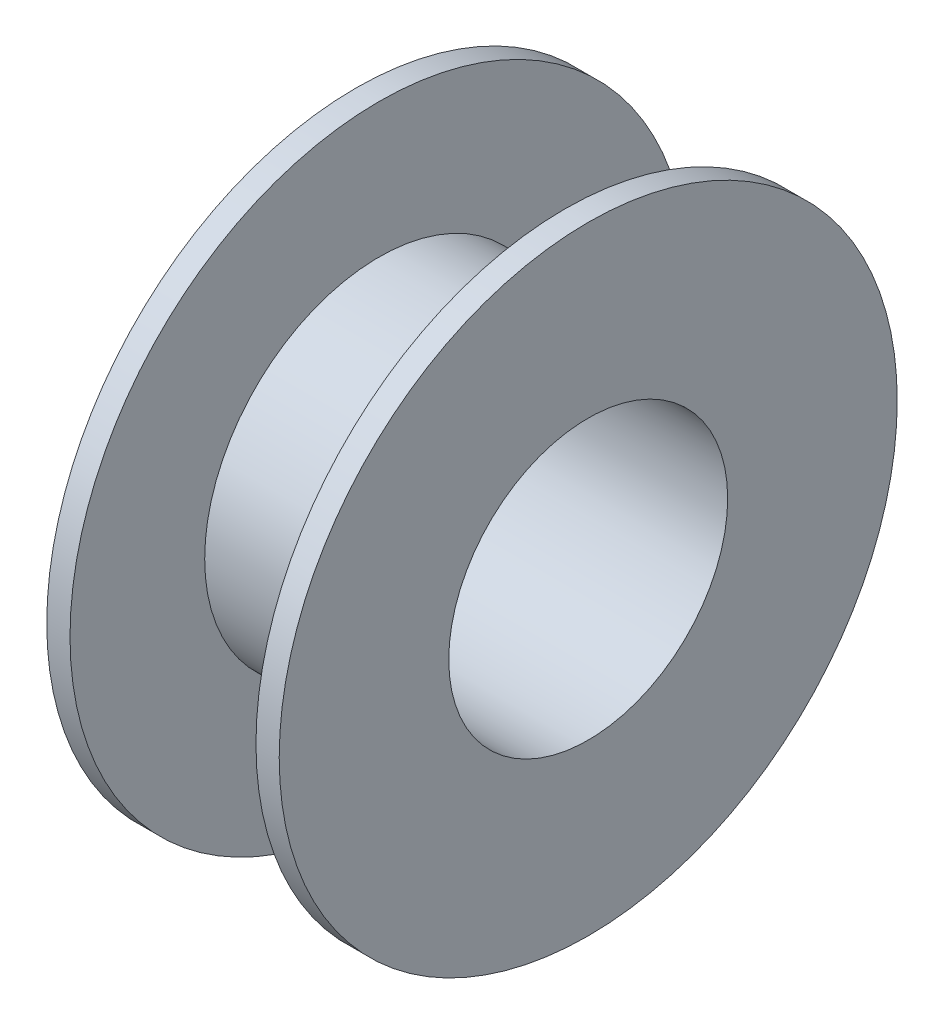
ISO-10303-21;
HEADER;
FILE_DESCRIPTION(('STEP AP214'),'2;1');
FILE_NAME('part.step','',(''),(''),'','','');
FILE_SCHEMA(('AUTOMOTIVE_DESIGN { 1 0 10303 214 1 1 1 1 }'));
ENDSEC;
DATA;
#1=APPLICATION_CONTEXT('core data for automotive mechanical design processes');
#2=APPLICATION_PROTOCOL_DEFINITION('international standard','automotive_design',2000,#1);
#3=PRODUCT_CONTEXT('',#1,'mechanical');
#4=PRODUCT('Part','Part','',(#3));
#5=PRODUCT_RELATED_PRODUCT_CATEGORY('part','',(#4));
#6=PRODUCT_DEFINITION_FORMATION('','',#4);
#7=PRODUCT_DEFINITION_CONTEXT('part definition',#1,'design');
#8=PRODUCT_DEFINITION('design','',#6,#7);
#9=PRODUCT_DEFINITION_SHAPE('','',#8);
#10=(LENGTH_UNIT() NAMED_UNIT(*) SI_UNIT(.MILLI.,.METRE.));
#11=(NAMED_UNIT(*) PLANE_ANGLE_UNIT() SI_UNIT($,.RADIAN.));
#12=(NAMED_UNIT(*) SI_UNIT($,.STERADIAN.) SOLID_ANGLE_UNIT());
#13=UNCERTAINTY_MEASURE_WITH_UNIT(LENGTH_MEASURE(1.E-05),#10,'distance_accuracy_value','');
#14=(GEOMETRIC_REPRESENTATION_CONTEXT(3) GLOBAL_UNCERTAINTY_ASSIGNED_CONTEXT((#13)) GLOBAL_UNIT_ASSIGNED_CONTEXT((#10,
#11,#12)) REPRESENTATION_CONTEXT('',''));
#15=CARTESIAN_POINT('',(0.,0.,0.));
#16=DIRECTION('',(0.,0.,1.));
#17=DIRECTION('',(1.,0.,0.));
#18=AXIS2_PLACEMENT_3D('',#15,#16,#17);
#19=CARTESIAN_POINT('',(10.,6.,0.));
#20=DIRECTION('',(-1.,0.,0.));
#21=DIRECTION('',(0.,0.,1.));
#22=AXIS2_PLACEMENT_3D('',#19,#20,#21);
#23=PLANE('',#22);
#24=CARTESIAN_POINT('',(10.,0.,0.));
#25=DIRECTION('',(-1.,0.,0.));
#26=DIRECTION('',(0.,0.,1.));
#27=AXIS2_PLACEMENT_3D('',#24,#25,#26);
#28=CIRCLE('',#27,13.2941176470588);
#29=CARTESIAN_POINT('',(10.,0.,13.2941176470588));
#30=VERTEX_POINT('',#29);
#31=EDGE_CURVE('E12',#30,#30,#28,.T.);
#32=ORIENTED_EDGE('',*,*,#31,.F.);
#33=EDGE_LOOP('',(#32));
#34=FACE_BOUND('',#33,.T.);
#35=CARTESIAN_POINT('',(10.,0.,0.));
#36=DIRECTION('',(-1.,0.,0.));
#37=DIRECTION('',(0.,0.,1.));
#38=AXIS2_PLACEMENT_3D('',#35,#36,#37);
#39=CIRCLE('',#38,6.);
#40=CARTESIAN_POINT('',(10.,0.,6.));
#41=VERTEX_POINT('',#40);
#42=EDGE_CURVE('E68',#41,#41,#39,.T.);
#43=ORIENTED_EDGE('',*,*,#42,.T.);
#44=EDGE_LOOP('',(#43));
#45=FACE_BOUND('',#44,.T.);
#46=ADVANCED_FACE('F40',(#34,#45),#23,.F.);
#47=CARTESIAN_POINT('',(0.,0.,0.));
#48=DIRECTION('',(-1.,0.,0.));
#49=DIRECTION('',(0.,0.,1.));
#50=AXIS2_PLACEMENT_3D('',#47,#48,#49);
#51=CYLINDRICAL_SURFACE('',#50,13.2941176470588);
#52=CARTESIAN_POINT('',(9.,0.,0.));
#53=DIRECTION('',(-1.,0.,0.));
#54=DIRECTION('',(0.,0.,1.));
#55=AXIS2_PLACEMENT_3D('',#52,#53,#54);
#56=CIRCLE('',#55,13.2941176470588);
#57=CARTESIAN_POINT('',(9.,0.,13.2941176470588));
#58=VERTEX_POINT('',#57);
#59=EDGE_CURVE('E46',#58,#58,#56,.T.);
#60=ORIENTED_EDGE('',*,*,#59,.F.);
#61=EDGE_LOOP('',(#60));
#62=FACE_BOUND('',#61,.T.);
#63=ORIENTED_EDGE('',*,*,#31,.T.);
#64=EDGE_LOOP('',(#63));
#65=FACE_BOUND('',#64,.T.);
#66=ADVANCED_FACE('F105',(#62,#65),#51,.T.);
#67=CARTESIAN_POINT('',(9.,7.5,0.));
#68=DIRECTION('',(1.,0.,0.));
#69=DIRECTION('',(0.,0.,-1.));
#70=AXIS2_PLACEMENT_3D('',#67,#68,#69);
#71=PLANE('',#70);
#72=CARTESIAN_POINT('',(9.,0.,0.));
#73=DIRECTION('',(-1.,0.,0.));
#74=DIRECTION('',(0.,0.,1.));
#75=AXIS2_PLACEMENT_3D('',#72,#73,#74);
#76=CIRCLE('',#75,7.5);
#77=CARTESIAN_POINT('',(9.,0.,7.5));
#78=VERTEX_POINT('',#77);
#79=EDGE_CURVE('E50',#78,#78,#76,.T.);
#80=ORIENTED_EDGE('',*,*,#79,.F.);
#81=EDGE_LOOP('',(#80));
#82=FACE_BOUND('',#81,.T.);
#83=ORIENTED_EDGE('',*,*,#59,.T.);
#84=EDGE_LOOP('',(#83));
#85=FACE_BOUND('',#84,.T.);
#86=ADVANCED_FACE('F100',(#82,#85),#71,.F.);
#87=CARTESIAN_POINT('',(0.,0.,0.));
#88=DIRECTION('',(-1.,0.,0.));
#89=DIRECTION('',(0.,0.,1.));
#90=AXIS2_PLACEMENT_3D('',#87,#88,#89);
#91=CYLINDRICAL_SURFACE('',#90,7.5);
#92=CARTESIAN_POINT('',(0.999999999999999,0.,0.));
#93=DIRECTION('',(-1.,0.,0.));
#94=DIRECTION('',(0.,0.,1.));
#95=AXIS2_PLACEMENT_3D('',#92,#93,#94);
#96=CIRCLE('',#95,7.5);
#97=CARTESIAN_POINT('',(0.999999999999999,0.,7.5));
#98=VERTEX_POINT('',#97);
#99=EDGE_CURVE('E54',#98,#98,#96,.T.);
#100=ORIENTED_EDGE('',*,*,#99,.F.);
#101=EDGE_LOOP('',(#100));
#102=FACE_BOUND('',#101,.T.);
#103=ORIENTED_EDGE('',*,*,#79,.T.);
#104=EDGE_LOOP('',(#103));
#105=FACE_BOUND('',#104,.T.);
#106=ADVANCED_FACE('F94',(#102,#105),#91,.T.);
#107=CARTESIAN_POINT('',(0.999999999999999,7.5,0.));
#108=DIRECTION('',(-1.,0.,0.));
#109=DIRECTION('',(0.,0.,1.));
#110=AXIS2_PLACEMENT_3D('',#107,#108,#109);
#111=PLANE('',#110);
#112=CARTESIAN_POINT('',(0.999999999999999,0.,0.));
#113=DIRECTION('',(-1.,0.,0.));
#114=DIRECTION('',(0.,0.,1.));
#115=AXIS2_PLACEMENT_3D('',#112,#113,#114);
#116=CIRCLE('',#115,13.2941176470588);
#117=CARTESIAN_POINT('',(0.999999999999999,0.,13.2941176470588));
#118=VERTEX_POINT('',#117);
#119=EDGE_CURVE('E59',#118,#118,#116,.T.);
#120=ORIENTED_EDGE('',*,*,#119,.F.);
#121=EDGE_LOOP('',(#120));
#122=FACE_BOUND('',#121,.T.);
#123=ORIENTED_EDGE('',*,*,#99,.T.);
#124=EDGE_LOOP('',(#123));
#125=FACE_BOUND('',#124,.T.);
#126=ADVANCED_FACE('F88',(#122,#125),#111,.F.);
#127=CARTESIAN_POINT('',(0.,0.,0.));
#128=DIRECTION('',(-1.,0.,0.));
#129=DIRECTION('',(0.,0.,1.));
#130=AXIS2_PLACEMENT_3D('',#127,#128,#129);
#131=CYLINDRICAL_SURFACE('',#130,13.2941176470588);
#132=CARTESIAN_POINT('',(0.,0.,0.));
#133=DIRECTION('',(-1.,0.,0.));
#134=DIRECTION('',(0.,0.,1.));
#135=AXIS2_PLACEMENT_3D('',#132,#133,#134);
#136=CIRCLE('',#135,13.2941176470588);
#137=CARTESIAN_POINT('',(0.,0.,13.2941176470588));
#138=VERTEX_POINT('',#137);
#139=EDGE_CURVE('E62',#138,#138,#136,.T.);
#140=ORIENTED_EDGE('',*,*,#139,.F.);
#141=EDGE_LOOP('',(#140));
#142=FACE_BOUND('',#141,.T.);
#143=ORIENTED_EDGE('',*,*,#119,.T.);
#144=EDGE_LOOP('',(#143));
#145=FACE_BOUND('',#144,.T.);
#146=ADVANCED_FACE('F82',(#142,#145),#131,.T.);
#147=CARTESIAN_POINT('',(0.,6.,0.));
#148=DIRECTION('',(1.,0.,0.));
#149=DIRECTION('',(0.,0.,-1.));
#150=AXIS2_PLACEMENT_3D('',#147,#148,#149);
#151=PLANE('',#150);
#152=CARTESIAN_POINT('',(0.,0.,0.));
#153=DIRECTION('',(-1.,0.,0.));
#154=DIRECTION('',(0.,0.,1.));
#155=AXIS2_PLACEMENT_3D('',#152,#153,#154);
#156=CIRCLE('',#155,6.);
#157=CARTESIAN_POINT('',(0.,0.,6.));
#158=VERTEX_POINT('',#157);
#159=EDGE_CURVE('E65',#158,#158,#156,.T.);
#160=ORIENTED_EDGE('',*,*,#159,.F.);
#161=EDGE_LOOP('',(#160));
#162=FACE_BOUND('',#161,.T.);
#163=ORIENTED_EDGE('',*,*,#139,.T.);
#164=EDGE_LOOP('',(#163));
#165=FACE_BOUND('',#164,.T.);
#166=ADVANCED_FACE('F76',(#162,#165),#151,.F.);
#167=CARTESIAN_POINT('',(0.,0.,0.));
#168=DIRECTION('',(-1.,0.,0.));
#169=DIRECTION('',(0.,0.,1.));
#170=AXIS2_PLACEMENT_3D('',#167,#168,#169);
#171=CYLINDRICAL_SURFACE('',#170,6.);
#172=ORIENTED_EDGE('',*,*,#42,.F.);
#173=EDGE_LOOP('',(#172));
#174=FACE_BOUND('',#173,.T.);
#175=ORIENTED_EDGE('',*,*,#159,.T.);
#176=EDGE_LOOP('',(#175));
#177=FACE_BOUND('',#176,.T.);
#178=ADVANCED_FACE('F73',(#174,#177),#171,.F.);
#179=CLOSED_SHELL('',(#46,#66,#86,#106,#126,#146,#166,#178));
#180=MANIFOLD_SOLID_BREP('B2',#179);
#181=ADVANCED_BREP_SHAPE_REPRESENTATION('',(#18,#180),#14);
#182=SHAPE_DEFINITION_REPRESENTATION(#9,#181);
ENDSEC;
END-ISO-10303-21;
